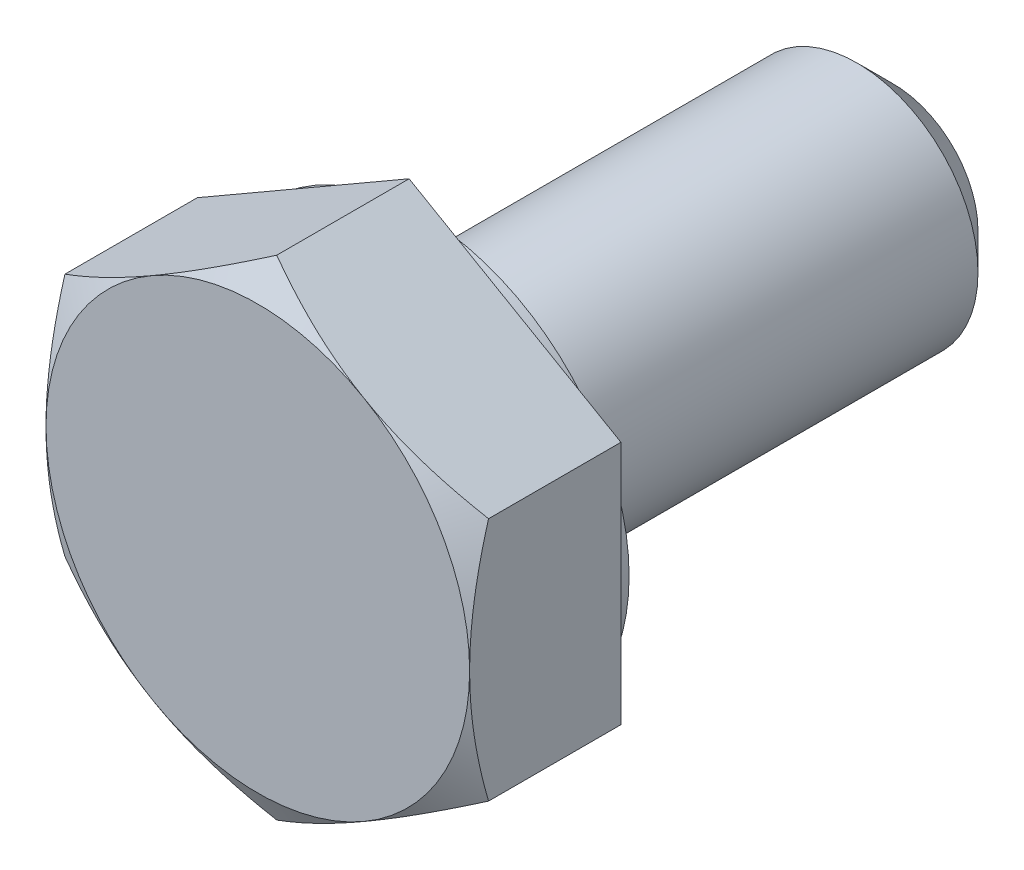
from build123d import *

# Parameters (mm, degrees)
SKETCH2_W           = 12.7
SKETCH2_H           = 3.175
BOSS_EXTRUDE1_DEPTH = 3.96875
SKETCH7_R           = 5.49275
BOSS_EXTRUDE2_DEPTH = 0.2778125
CHAMFER1_SIZE       = 0.9525
SKETCH4_OUTSIDE_W   = 86.13
SKETCH4_OUTSIDE_H   = 87.85
SKETCH4_OUTSIDE_R   = 5.55625
CUT_EXTRUDE1_DEPTH  = 19.705124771
CUT_EXTRUDE1_DRAFT  = -60
BOSS_EXTRUDE3_START = -0.2778125
SKETCH8_R           = 5.49275
BOSS_EXTRUDE3_DEPTH = 0.2778125


with BuildPart() as part:
    # Sketch2 → Revolve1 (revolve)
    with BuildSketch(Plane(origin=(0, 0, 0), x_dir=(0, 0, -1), z_dir=(1, 0, 0)), mode=Mode.PRIVATE) as revolve1_sk:
        with Locations((6.35, 1.5875)):
            Rectangle(SKETCH2_W, SKETCH2_H)
    revolve(revolve1_sk.sketch.rotate(Axis((0, 0, 0), (0, 0, -1)), 90), axis=Axis((0, 0, 0), (0, 0, -1)))

    # Sketch3 → Boss-Extrude1 (add)
    with BuildSketch(Plane.XY):
        Polygon((0, 6.415804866), (-5.55625, 3.207902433), (-5.55625, -3.207902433), (0, -6.415804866), (5.55625, -3.207902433), (5.55625, 3.207902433), align=None)
    extrude(amount=BOSS_EXTRUDE1_DEPTH)

    # Sketch7 → Boss-Extrude2 (add)
    with BuildSketch(Plane(origin=(0, 0, 0), x_dir=(-1, 0, 0), z_dir=(0, 0, -1))):
        with Locations(Location((0, 0, 0), (0, 0, 180))):
            Circle(SKETCH7_R)
    extrude(amount=BOSS_EXTRUDE2_DEPTH)

    # Chamfer1
    chamfer1_edges = [part.edges().sort_by_distance(p)[0] for p in [
        (-3.175, 0, -12.7),
    ]]
    chamfer(chamfer1_edges, length=CHAMFER1_SIZE)


with BuildPart() as cut_extrude1_tool:
    # Sketch4 outside → Cut-Extrude1 (with draft: the straight prism first)
    with BuildSketch(Plane.XY.offset(3.96875)):
        Rectangle(SKETCH4_OUTSIDE_W, SKETCH4_OUTSIDE_H)
        Circle(SKETCH4_OUTSIDE_R, mode=Mode.SUBTRACT)
    extrude(amount=-CUT_EXTRUDE1_DEPTH)
    # Cut-Extrude1: the draft: its side faces are tilted about the plane it starts from
    cut_extrude1_sides = [cut_extrude1_tool.faces().sort_by_distance(p)[0] for p in [
        (0, -43.925, -5.883812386),
        (43.065, 0, -5.883812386),
        (0, 43.925, -5.883812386),
        (-43.065, 0, -5.883812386),
        (-5.55625, 0, -5.883812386),
    ]]
    draft(cut_extrude1_sides, Plane.XY.offset(3.96875), CUT_EXTRUDE1_DRAFT)


with BuildPart() as part_1:
    add(part.part)

    # Cut-Extrude1: cut by cut_extrude1_tool
    add(cut_extrude1_tool.part, mode=Mode.SUBTRACT)

    # Sketch8 → Boss-Extrude3 (add)
    with BuildSketch(Plane(origin=(0, 0, -0.2778125), x_dir=(-1, 0, 0), z_dir=(0, 0, -1)).offset(BOSS_EXTRUDE3_START)):
        with Locations(Location((0, 0, 0), (0, 0, 180))):
            Circle(SKETCH8_R)
    extrude(amount=BOSS_EXTRUDE3_DEPTH)


solid = part_1.part
